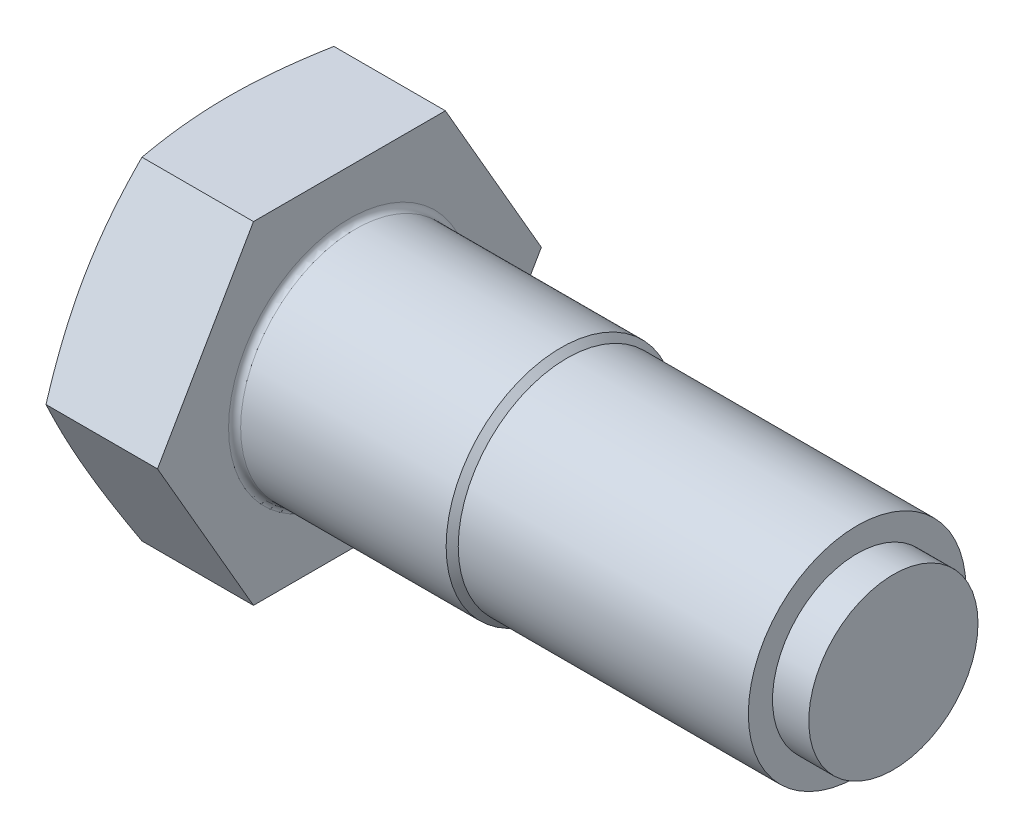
ISO-10303-21;
HEADER;
FILE_DESCRIPTION(('STEP AP214'),'2;1');
FILE_NAME('part.step','',(''),(''),'','','');
FILE_SCHEMA(('AUTOMOTIVE_DESIGN { 1 0 10303 214 1 1 1 1 }'));
ENDSEC;
DATA;
#1=APPLICATION_CONTEXT('core data for automotive mechanical design processes');
#2=APPLICATION_PROTOCOL_DEFINITION('international standard','automotive_design',2000,#1);
#3=PRODUCT_CONTEXT('',#1,'mechanical');
#4=PRODUCT('Part','Part','',(#3));
#5=PRODUCT_RELATED_PRODUCT_CATEGORY('part','',(#4));
#6=PRODUCT_DEFINITION_FORMATION('','',#4);
#7=PRODUCT_DEFINITION_CONTEXT('part definition',#1,'design');
#8=PRODUCT_DEFINITION('design','',#6,#7);
#9=PRODUCT_DEFINITION_SHAPE('','',#8);
#10=(LENGTH_UNIT() NAMED_UNIT(*) SI_UNIT(.MILLI.,.METRE.));
#11=(NAMED_UNIT(*) PLANE_ANGLE_UNIT() SI_UNIT($,.RADIAN.));
#12=(NAMED_UNIT(*) SI_UNIT($,.STERADIAN.) SOLID_ANGLE_UNIT());
#13=UNCERTAINTY_MEASURE_WITH_UNIT(LENGTH_MEASURE(1.E-05),#10,'distance_accuracy_value','');
#14=(GEOMETRIC_REPRESENTATION_CONTEXT(3) GLOBAL_UNCERTAINTY_ASSIGNED_CONTEXT((#13)) GLOBAL_UNIT_ASSIGNED_CONTEXT((#10,
#11,#12)) REPRESENTATION_CONTEXT('',''));
#15=CARTESIAN_POINT('',(0.,0.,0.));
#16=DIRECTION('',(0.,0.,1.));
#17=DIRECTION('',(1.,0.,0.));
#18=AXIS2_PLACEMENT_3D('',#15,#16,#17);
#19=CARTESIAN_POINT('',(20.,-27.5,-15.8771324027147));
#20=DIRECTION('',(0.,0.5,0.866025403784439));
#21=DIRECTION('',(0.,-0.866025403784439,0.5));
#22=AXIS2_PLACEMENT_3D('',#19,#20,#21);
#23=PLANE('',#22);
#24=CARTESIAN_POINT('',(1.54846778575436,0.00020000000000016,-31.7543802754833));
#25=CARTESIAN_POINT('',(1.4288019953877,-0.569305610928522,-31.4255760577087));
#26=CARTESIAN_POINT('',(1.314517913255,-1.13964819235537,-31.0962886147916));
#27=CARTESIAN_POINT('',(1.09789705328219,-2.28208500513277,-30.4367024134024));
#28=CARTESIAN_POINT('',(0.995561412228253,-2.85417939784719,-30.1064035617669));
#29=CARTESIAN_POINT('',(0.708153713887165,-4.57383623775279,-29.1135592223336));
#30=CARTESIAN_POINT('',(0.542849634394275,-5.72398507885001,-28.449520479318));
#31=CARTESIAN_POINT('',(0.341953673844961,-7.44775186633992,-27.4543032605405));
#32=CARTESIAN_POINT('',(0.283002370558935,-8.01938098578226,-27.1242730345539));
#33=CARTESIAN_POINT('',(0.181195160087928,-9.16373285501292,-26.4635811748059));
#34=CARTESIAN_POINT('',(0.138339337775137,-9.73645561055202,-26.1329195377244));
#35=CARTESIAN_POINT('',(0.0694763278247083,-10.8824518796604,-25.4712782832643));
#36=CARTESIAN_POINT('',(0.0434629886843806,-11.4557251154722,-25.1402988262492));
#37=CARTESIAN_POINT('',(0.00872485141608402,-12.6026655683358,-24.4781124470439));
#38=CARTESIAN_POINT('',(0.,-13.1763327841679,-24.146905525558));
#39=CARTESIAN_POINT('',(0.,-14.3236672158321,-23.4844916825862));
#40=CARTESIAN_POINT('',(0.00872485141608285,-14.8973344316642,-23.1532847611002));
#41=CARTESIAN_POINT('',(0.0434629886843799,-16.0442748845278,-22.4910983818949));
#42=CARTESIAN_POINT('',(0.0694763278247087,-16.6175481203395,-22.1601189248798));
#43=CARTESIAN_POINT('',(0.138339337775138,-17.763544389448,-21.4984776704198));
#44=CARTESIAN_POINT('',(0.181195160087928,-18.3362671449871,-21.1678160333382));
#45=CARTESIAN_POINT('',(0.283002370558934,-19.4806190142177,-20.5071241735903));
#46=CARTESIAN_POINT('',(0.34195367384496,-20.0522481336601,-20.1770939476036));
#47=CARTESIAN_POINT('',(0.542849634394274,-21.77601492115,-19.1818767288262));
#48=CARTESIAN_POINT('',(0.708153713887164,-22.9261637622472,-18.5178379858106));
#49=CARTESIAN_POINT('',(0.995561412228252,-24.6458206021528,-17.5249936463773));
#50=CARTESIAN_POINT('',(1.09789705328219,-25.2179149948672,-17.1946947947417));
#51=CARTESIAN_POINT('',(1.314517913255,-26.3603518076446,-16.5351085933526));
#52=CARTESIAN_POINT('',(1.4288019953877,-26.9306943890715,-16.2058211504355));
#53=CARTESIAN_POINT('',(1.54846778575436,-27.5002,-15.8770169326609));
#54=B_SPLINE_CURVE_WITH_KNOTS('',3,(#24,#25,#26,#27,#28,#29,#30,#31,#32,#33,#34,#35,#36,#37,#38,
#39,#40,#41,#42,#43,#44,#45,#46,#47,#48,#49,#50,#51,#52,#53),.UNSPECIFIED.,.F.,.F.,(4,2,2,2,2,2,
2,2,2,2,2,2,2,2,4),(0.,2.00516331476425,4.0105172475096,8.0239972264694,10.0119037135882,
11.9998206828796,13.987011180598,15.9741955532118,17.9613799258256,19.9485704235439,
21.9364873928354,23.9243938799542,27.937873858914,29.9432277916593,31.9483911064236),.UNSPECIFIED.);
#55=CARTESIAN_POINT('',(1.54842575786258,0.,-31.7542648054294));
#56=VERTEX_POINT('',#55);
#57=CARTESIAN_POINT('',(0.,-13.75,-23.8156986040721));
#58=VERTEX_POINT('',#57);
#59=EDGE_CURVE('E117',#56,#58,#54,.T.);
#60=ORIENTED_EDGE('',*,*,#59,.F.);
#61=DIRECTION('',(-1.,0.,0.));
#62=VECTOR('',#61,1.);
#63=CARTESIAN_POINT('',(20.,0.,-31.7542648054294));
#64=LINE('',#63,#62);
#65=CARTESIAN_POINT('',(20.,0.,-31.7542648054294));
#66=VERTEX_POINT('',#65);
#67=EDGE_CURVE('E146',#66,#56,#64,.T.);
#68=ORIENTED_EDGE('',*,*,#67,.F.);
#69=DIRECTION('',(0.,0.866025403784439,-0.5));
#70=VECTOR('',#69,1.);
#71=CARTESIAN_POINT('',(20.,-27.5,-15.8771324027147));
#72=LINE('',#71,#70);
#73=CARTESIAN_POINT('',(20.,-27.5,-15.8771324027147));
#74=VERTEX_POINT('',#73);
#75=EDGE_CURVE('E181',#74,#66,#72,.T.);
#76=ORIENTED_EDGE('',*,*,#75,.F.);
#77=DIRECTION('',(-1.,0.,0.));
#78=VECTOR('',#77,1.);
#79=CARTESIAN_POINT('',(20.,-27.5,-15.8771324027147));
#80=LINE('',#79,#78);
#81=CARTESIAN_POINT('',(1.54842575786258,-27.5,-15.8771324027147));
#82=VERTEX_POINT('',#81);
#83=EDGE_CURVE('E140',#74,#82,#80,.T.);
#84=ORIENTED_EDGE('',*,*,#83,.T.);
#85=EDGE_CURVE('E202',#58,#82,#54,.T.);
#86=ORIENTED_EDGE('',*,*,#85,.F.);
#87=EDGE_LOOP('',(#60,#68,#76,#84,#86));
#88=FACE_BOUND('',#87,.T.);
#89=ADVANCED_FACE('F35',(#88),#23,.F.);
#90=CARTESIAN_POINT('',(20.,0.,-31.7542648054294));
#91=DIRECTION('',(0.,-0.5,0.866025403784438));
#92=DIRECTION('',(0.,-0.866025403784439,-0.5));
#93=AXIS2_PLACEMENT_3D('',#90,#91,#92);
#94=PLANE('',#93);
#95=CARTESIAN_POINT('',(1.54846778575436,27.5002,-15.8770169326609));
#96=CARTESIAN_POINT('',(1.42880199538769,26.9306943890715,-16.2058211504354));
#97=CARTESIAN_POINT('',(1.314517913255,26.3603518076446,-16.5351085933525));
#98=CARTESIAN_POINT('',(1.09789705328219,25.2179149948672,-17.1946947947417));
#99=CARTESIAN_POINT('',(0.99556141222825,24.6458206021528,-17.5249936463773));
#100=CARTESIAN_POINT('',(0.708153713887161,22.9261637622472,-18.5178379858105));
#101=CARTESIAN_POINT('',(0.542849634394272,21.77601492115,-19.1818767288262));
#102=CARTESIAN_POINT('',(0.341953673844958,20.0522481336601,-20.1770939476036));
#103=CARTESIAN_POINT('',(0.283002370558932,19.4806190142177,-20.5071241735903));
#104=CARTESIAN_POINT('',(0.181195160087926,18.3362671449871,-21.1678160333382));
#105=CARTESIAN_POINT('',(0.138339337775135,17.763544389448,-21.4984776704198));
#106=CARTESIAN_POINT('',(0.0694763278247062,16.6175481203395,-22.1601189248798));
#107=CARTESIAN_POINT('',(0.0434629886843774,16.0442748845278,-22.4910983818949));
#108=CARTESIAN_POINT('',(0.00872485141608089,14.8973344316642,-23.1532847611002));
#109=CARTESIAN_POINT('',(0.,14.3236672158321,-23.4844916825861));
#110=CARTESIAN_POINT('',(0.,13.1763327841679,-24.146905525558));
#111=CARTESIAN_POINT('',(0.00872485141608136,12.6026655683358,-24.4781124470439));
#112=CARTESIAN_POINT('',(0.0434629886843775,11.4557251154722,-25.1402988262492));
#113=CARTESIAN_POINT('',(0.0694763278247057,10.8824518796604,-25.4712782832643));
#114=CARTESIAN_POINT('',(0.138339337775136,9.73645561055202,-26.1329195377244));
#115=CARTESIAN_POINT('',(0.181195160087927,9.16373285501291,-26.4635811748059));
#116=CARTESIAN_POINT('',(0.283002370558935,8.01938098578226,-27.1242730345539));
#117=CARTESIAN_POINT('',(0.341953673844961,7.44775186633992,-27.4543032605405));
#118=CARTESIAN_POINT('',(0.542849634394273,5.72398507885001,-28.449520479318));
#119=CARTESIAN_POINT('',(0.708153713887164,4.57383623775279,-29.1135592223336));
#120=CARTESIAN_POINT('',(0.995561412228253,2.85417939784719,-30.1064035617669));
#121=CARTESIAN_POINT('',(1.09789705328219,2.28208500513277,-30.4367024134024));
#122=CARTESIAN_POINT('',(1.314517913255,1.13964819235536,-31.0962886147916));
#123=CARTESIAN_POINT('',(1.4288019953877,0.56930561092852,-31.4255760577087));
#124=CARTESIAN_POINT('',(1.54846778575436,-0.000199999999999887,-31.7543802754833));
#125=B_SPLINE_CURVE_WITH_KNOTS('',3,(#95,#96,#97,#98,#99,#100,#101,#102,#103,#104,#105,#106,
#107,#108,#109,#110,#111,#112,#113,#114,#115,#116,#117,#118,#119,#120,#121,#122,#123,#124),
.UNSPECIFIED.,.F.,.F.,(4,2,2,2,2,2,2,2,2,2,2,2,2,2,4),(0.,2.00516331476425,4.0105172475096,
8.0239972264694,10.0119037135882,11.9998206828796,13.987011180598,15.9741955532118,
17.9613799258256,19.948570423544,21.9364873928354,23.9243938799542,27.937873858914,
29.9432277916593,31.9483911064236),.UNSPECIFIED.);
#126=CARTESIAN_POINT('',(1.54842575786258,27.5,-15.8771324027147));
#127=VERTEX_POINT('',#126);
#128=CARTESIAN_POINT('',(0.,13.75,-23.8156986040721));
#129=VERTEX_POINT('',#128);
#130=EDGE_CURVE('E253',#127,#129,#125,.T.);
#131=ORIENTED_EDGE('',*,*,#130,.F.);
#132=DIRECTION('',(-1.,0.,0.));
#133=VECTOR('',#132,1.);
#134=CARTESIAN_POINT('',(20.,27.5,-15.8771324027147));
#135=LINE('',#134,#133);
#136=CARTESIAN_POINT('',(20.,27.5,-15.8771324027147));
#137=VERTEX_POINT('',#136);
#138=EDGE_CURVE('E137',#137,#127,#135,.T.);
#139=ORIENTED_EDGE('',*,*,#138,.F.);
#140=DIRECTION('',(0.,0.866025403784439,0.5));
#141=VECTOR('',#140,1.);
#142=CARTESIAN_POINT('',(20.,0.,-31.7542648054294));
#143=LINE('',#142,#141);
#144=EDGE_CURVE('E184',#66,#137,#143,.T.);
#145=ORIENTED_EDGE('',*,*,#144,.F.);
#146=ORIENTED_EDGE('',*,*,#67,.T.);
#147=EDGE_CURVE('E129',#129,#56,#125,.T.);
#148=ORIENTED_EDGE('',*,*,#147,.F.);
#149=EDGE_LOOP('',(#131,#139,#145,#146,#148));
#150=FACE_BOUND('',#149,.T.);
#151=ADVANCED_FACE('F259',(#150),#94,.F.);
#152=CARTESIAN_POINT('',(20.,27.5,-15.8771324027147));
#153=DIRECTION('',(0.,-1.,0.));
#154=DIRECTION('',(0.,0.,-1.));
#155=AXIS2_PLACEMENT_3D('',#152,#153,#154);
#156=PLANE('',#155);
#157=CARTESIAN_POINT('',(8.27417466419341,27.5,-42.0370686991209));
#158=CARTESIAN_POINT('',(8.08469919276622,27.5,-41.4149780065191));
#159=CARTESIAN_POINT('',(7.89636957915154,27.5,-40.7925385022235));
#160=CARTESIAN_POINT('',(7.52225859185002,27.5,-39.5468904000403));
#161=CARTESIAN_POINT('',(7.33647723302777,27.5,-38.9236817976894));
#162=CARTESIAN_POINT('',(6.78331637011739,27.5,-37.0527138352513));
#163=CARTESIAN_POINT('',(6.42014816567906,27.5,-35.8037042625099));
#164=CARTESIAN_POINT('',(5.70696403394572,27.5,-33.2994065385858));
#165=CARTESIAN_POINT('',(5.35697390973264,27.5,-32.044111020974));
#166=CARTESIAN_POINT('',(4.67421339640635,27.5,-29.52885103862));
#167=CARTESIAN_POINT('',(4.34144269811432,27.5,-28.268886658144));
#168=CARTESIAN_POINT('',(3.70136564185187,27.5,-25.7590181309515));
#169=CARTESIAN_POINT('',(3.39379590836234,27.5,-24.5091814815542));
#170=CARTESIAN_POINT('',(2.80484197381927,27.5,-22.003288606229));
#171=CARTESIAN_POINT('',(2.52345821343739,27.5,-20.7472322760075));
#172=CARTESIAN_POINT('',(1.99343662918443,27.5,-18.2286202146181));
#173=CARTESIAN_POINT('',(1.74478763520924,27.5,-16.9660668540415));
#174=CARTESIAN_POINT('',(1.2878080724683,27.5,-14.4336263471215));
#175=CARTESIAN_POINT('',(1.07947615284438,27.5,-13.1637394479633));
#176=CARTESIAN_POINT('',(0.73221733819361,27.5,-10.7596434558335));
#177=CARTESIAN_POINT('',(0.588127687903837,27.5,-9.62618566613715));
#178=CARTESIAN_POINT('',(0.344229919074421,27.5,-7.35443322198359));
#179=CARTESIAN_POINT('',(0.244420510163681,27.5,-6.21613870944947));
#180=CARTESIAN_POINT('',(0.131462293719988,27.5,-4.50671356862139));
#181=CARTESIAN_POINT('',(0.0999397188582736,27.5,-3.9367559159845));
#182=CARTESIAN_POINT('',(0.0495040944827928,27.5,-2.79628740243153));
#183=CARTESIAN_POINT('',(0.0305907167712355,27.5,-2.22577655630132));
#184=CARTESIAN_POINT('',(0.00563365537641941,27.5,-1.08446909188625));
#185=CARTESIAN_POINT('',(-0.000409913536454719,27.5,-0.513672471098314));
#186=CARTESIAN_POINT('',(0.000453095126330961,27.5,0.627911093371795));
#187=CARTESIAN_POINT('',(0.00735967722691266,27.5,1.19869803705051));
#188=CARTESIAN_POINT('',(0.0340986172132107,27.5,2.34285703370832));
#189=CARTESIAN_POINT('',(0.0539961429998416,27.5,2.91622756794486));
#190=CARTESIAN_POINT('',(0.106503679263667,27.5,4.06239080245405));
#191=CARTESIAN_POINT('',(0.139114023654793,27.5,4.63518348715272));
#192=CARTESIAN_POINT('',(0.255413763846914,27.5,6.35229309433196));
#193=CARTESIAN_POINT('',(0.35757329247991,27.5,7.49539945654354));
#194=CARTESIAN_POINT('',(0.606427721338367,27.5,9.77763572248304));
#195=CARTESIAN_POINT('',(0.753160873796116,27.5,10.9167613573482));
#196=CARTESIAN_POINT('',(1.08519470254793,27.5,13.1893257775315));
#197=CARTESIAN_POINT('',(1.27049558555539,27.5,14.322764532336));
#198=CARTESIAN_POINT('',(1.68430124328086,27.5,16.6435833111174));
#199=CARTESIAN_POINT('',(1.91457283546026,27.5,17.8306453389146));
#200=CARTESIAN_POINT('',(2.40475304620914,27.5,20.1986744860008));
#201=CARTESIAN_POINT('',(2.66466389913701,27.5,21.3796411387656));
#202=CARTESIAN_POINT('',(3.20866537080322,27.5,23.7363199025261));
#203=CARTESIAN_POINT('',(3.49276301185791,27.5,24.9120303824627));
#204=CARTESIAN_POINT('',(4.08051653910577,27.5,27.2584986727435));
#205=CARTESIAN_POINT('',(4.38417195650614,27.5,28.4292566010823));
#206=CARTESIAN_POINT('',(5.00778544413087,27.5,30.7680175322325));
#207=CARTESIAN_POINT('',(5.32776395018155,27.5,31.9360150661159));
#208=CARTESIAN_POINT('',(5.98073735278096,27.5,34.2683610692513));
#209=CARTESIAN_POINT('',(6.31373230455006,27.5,35.4327095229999));
#210=CARTESIAN_POINT('',(6.99035616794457,27.5,37.7580938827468));
#211=CARTESIAN_POINT('',(7.33398328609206,27.5,38.919130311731));
#212=CARTESIAN_POINT('',(8.03007735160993,27.5,41.238543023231));
#213=CARTESIAN_POINT('',(8.38254428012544,27.5,42.396919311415));
#214=CARTESIAN_POINT('',(9.09091346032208,27.5,44.6986248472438));
#215=CARTESIAN_POINT('',(9.44673482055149,27.5,45.841979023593));
#216=CARTESIAN_POINT('',(10.1644386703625,27.5,48.1267816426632));
#217=CARTESIAN_POINT('',(10.5263211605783,27.5,49.2682300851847));
#218=CARTESIAN_POINT('',(11.2552369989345,27.5,51.5495374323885));
#219=CARTESIAN_POINT('',(11.622270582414,27.5,52.689396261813));
#220=CARTESIAN_POINT('',(12.3607173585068,27.5,54.9676946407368));
#221=CARTESIAN_POINT('',(12.7321305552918,27.5,56.106134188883));
#222=CARTESIAN_POINT('',(13.4772990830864,27.5,58.377460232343));
#223=CARTESIAN_POINT('',(13.8510401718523,27.5,59.5103514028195));
#224=CARTESIAN_POINT('',(14.6017474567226,27.5,61.7750649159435));
#225=CARTESIAN_POINT('',(14.9787136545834,27.5,62.9068872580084));
#226=CARTESIAN_POINT('',(15.7354151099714,27.5,65.169502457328));
#227=CARTESIAN_POINT('',(16.115150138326,27.5,66.3002953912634));
#228=CARTESIAN_POINT('',(16.8770773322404,27.5,68.5610502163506));
#229=CARTESIAN_POINT('',(17.2592694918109,27.5,69.6910121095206));
#230=CARTESIAN_POINT('',(17.6425199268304,27.5,70.8206140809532));
#231=B_SPLINE_CURVE_WITH_KNOTS('',3,(#157,#158,#159,#160,#161,#162,#163,#164,#165,#166,#167,
#168,#169,#170,#171,#172,#173,#174,#175,#176,#177,#178,#179,#180,#181,#182,#183,#184,#185,#186,
#187,#188,#189,#190,#191,#192,#193,#194,#195,#196,#197,#198,#199,#200,#201,#202,#203,#204,#205,
#206,#207,#208,#209,#210,#211,#212,#213,#214,#215,#216,#217,#218,#219,#220,#221,#222,#223,#224,
#225,#226,#227,#228,#229,#230),.UNSPECIFIED.,.F.,.F.,(4,2,2,2,2,2,2,2,2,2,2,2,2,2,2,2,2,2,2,2,2,
2,2,2,2,2,2,2,2,2,2,2,2,2,2,2,4),(0.,1.95091567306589,3.90184272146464,7.80398521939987,
11.713408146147,15.6227608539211,19.4839132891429,23.3451306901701,27.2050270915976,
31.0647941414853,34.4918070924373,37.9187201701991,39.6310896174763,41.3434144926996,
43.0557546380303,44.7680953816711,46.4890926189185,48.2101350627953,51.652046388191,
55.0969198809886,58.5418118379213,62.168920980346,65.7963037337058,69.4247432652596,
73.0530958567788,76.6861081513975,80.3191358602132,83.9515540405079,87.583964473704,
91.1762710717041,94.7685780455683,98.361049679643,101.953524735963,105.532363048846,
109.111203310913,112.689750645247,116.26828926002),.UNSPECIFIED.);
#232=CARTESIAN_POINT('',(1.54842575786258,27.5,15.8771324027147));
#233=VERTEX_POINT('',#232);
#234=CARTESIAN_POINT('',(0.,27.5,0.));
#235=VERTEX_POINT('',#234);
#236=EDGE_CURVE('E418',#233,#235,#231,.F.);
#237=ORIENTED_EDGE('',*,*,#236,.F.);
#238=DIRECTION('',(-1.,0.,0.));
#239=VECTOR('',#238,1.);
#240=CARTESIAN_POINT('',(20.,27.5,15.8771324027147));
#241=LINE('',#240,#239);
#242=CARTESIAN_POINT('',(20.,27.5,15.8771324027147));
#243=VERTEX_POINT('',#242);
#244=EDGE_CURVE('E134',#243,#233,#241,.T.);
#245=ORIENTED_EDGE('',*,*,#244,.F.);
#246=DIRECTION('',(0.,0.,1.));
#247=VECTOR('',#246,1.);
#248=CARTESIAN_POINT('',(20.,27.5,-15.8771324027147));
#249=LINE('',#248,#247);
#250=EDGE_CURVE('E190',#137,#243,#249,.T.);
#251=ORIENTED_EDGE('',*,*,#250,.F.);
#252=ORIENTED_EDGE('',*,*,#138,.T.);
#253=EDGE_CURVE('E254',#235,#127,#231,.F.);
#254=ORIENTED_EDGE('',*,*,#253,.F.);
#255=EDGE_LOOP('',(#237,#245,#251,#252,#254));
#256=FACE_BOUND('',#255,.T.);
#257=ADVANCED_FACE('F262',(#256),#156,.F.);
#258=CARTESIAN_POINT('',(20.,27.5,15.8771324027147));
#259=DIRECTION('',(0.,-0.5,-0.866025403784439));
#260=DIRECTION('',(0.,0.866025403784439,-0.5));
#261=AXIS2_PLACEMENT_3D('',#258,#259,#260);
#262=PLANE('',#261);
#263=CARTESIAN_POINT('',(1.54846778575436,-0.000199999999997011,31.7543802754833));
#264=CARTESIAN_POINT('',(1.42880199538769,0.569305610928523,31.4255760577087));
#265=CARTESIAN_POINT('',(1.314517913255,1.13964819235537,31.0962886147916));
#266=CARTESIAN_POINT('',(1.09789705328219,2.28208500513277,30.4367024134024));
#267=CARTESIAN_POINT('',(0.995561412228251,2.85417939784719,30.1064035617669));
#268=CARTESIAN_POINT('',(0.708153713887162,4.5738362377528,29.1135592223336));
#269=CARTESIAN_POINT('',(0.542849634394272,5.72398507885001,28.449520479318));
#270=CARTESIAN_POINT('',(0.341953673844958,7.44775186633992,27.4543032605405));
#271=CARTESIAN_POINT('',(0.283002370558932,8.01938098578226,27.1242730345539));
#272=CARTESIAN_POINT('',(0.181195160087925,9.16373285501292,26.4635811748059));
#273=CARTESIAN_POINT('',(0.138339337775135,9.73645561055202,26.1329195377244));
#274=CARTESIAN_POINT('',(0.0694763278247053,10.8824518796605,25.4712782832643));
#275=CARTESIAN_POINT('',(0.0434629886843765,11.4557251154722,25.1402988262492));
#276=CARTESIAN_POINT('',(0.00872485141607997,12.6026655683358,24.4781124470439));
#277=CARTESIAN_POINT('',(0.,13.1763327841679,24.146905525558));
#278=CARTESIAN_POINT('',(0.,14.3236672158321,23.4844916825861));
#279=CARTESIAN_POINT('',(0.00872485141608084,14.8973344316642,23.1532847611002));
#280=CARTESIAN_POINT('',(0.0434629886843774,16.0442748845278,22.4910983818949));
#281=CARTESIAN_POINT('',(0.0694763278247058,16.6175481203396,22.1601189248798));
#282=CARTESIAN_POINT('',(0.138339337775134,17.763544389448,21.4984776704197));
#283=CARTESIAN_POINT('',(0.181195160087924,18.3362671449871,21.1678160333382));
#284=CARTESIAN_POINT('',(0.283002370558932,19.4806190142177,20.5071241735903));
#285=CARTESIAN_POINT('',(0.341953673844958,20.0522481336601,20.1770939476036));
#286=CARTESIAN_POINT('',(0.542849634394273,21.77601492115,19.1818767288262));
#287=CARTESIAN_POINT('',(0.708153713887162,22.9261637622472,18.5178379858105));
#288=CARTESIAN_POINT('',(0.995561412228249,24.6458206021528,17.5249936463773));
#289=CARTESIAN_POINT('',(1.09789705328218,25.2179149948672,17.1946947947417));
#290=CARTESIAN_POINT('',(1.314517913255,26.3603518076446,16.5351085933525));
#291=CARTESIAN_POINT('',(1.42880199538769,26.9306943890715,16.2058211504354));
#292=CARTESIAN_POINT('',(1.54846778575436,27.5002,15.8770169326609));
#293=B_SPLINE_CURVE_WITH_KNOTS('',3,(#263,#264,#265,#266,#267,#268,#269,#270,#271,#272,#273,
#274,#275,#276,#277,#278,#279,#280,#281,#282,#283,#284,#285,#286,#287,#288,#289,#290,#291,#292),
.UNSPECIFIED.,.F.,.F.,(4,2,2,2,2,2,2,2,2,2,2,2,2,2,4),(0.,2.00516331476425,4.0105172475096,
8.0239972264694,10.0119037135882,11.9998206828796,13.987011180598,15.9741955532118,
17.9613799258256,19.948570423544,21.9364873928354,23.9243938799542,27.937873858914,
29.9432277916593,31.9483911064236),.UNSPECIFIED.);
#294=CARTESIAN_POINT('',(1.54842575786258,0.,31.7542648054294));
#295=VERTEX_POINT('',#294);
#296=CARTESIAN_POINT('',(0.,13.75,23.8156986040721));
#297=VERTEX_POINT('',#296);
#298=EDGE_CURVE('E111',#295,#297,#293,.T.);
#299=ORIENTED_EDGE('',*,*,#298,.F.);
#300=DIRECTION('',(-1.,0.,0.));
#301=VECTOR('',#300,1.);
#302=CARTESIAN_POINT('',(20.,0.,31.7542648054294));
#303=LINE('',#302,#301);
#304=CARTESIAN_POINT('',(20.,0.,31.7542648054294));
#305=VERTEX_POINT('',#304);
#306=EDGE_CURVE('E125',#305,#295,#303,.T.);
#307=ORIENTED_EDGE('',*,*,#306,.F.);
#308=DIRECTION('',(0.,-0.866025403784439,0.5));
#309=VECTOR('',#308,1.);
#310=CARTESIAN_POINT('',(20.,27.5,15.8771324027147));
#311=LINE('',#310,#309);
#312=EDGE_CURVE('E192',#243,#305,#311,.T.);
#313=ORIENTED_EDGE('',*,*,#312,.F.);
#314=ORIENTED_EDGE('',*,*,#244,.T.);
#315=EDGE_CURVE('E128',#297,#233,#293,.T.);
#316=ORIENTED_EDGE('',*,*,#315,.F.);
#317=EDGE_LOOP('',(#299,#307,#313,#314,#316));
#318=FACE_BOUND('',#317,.T.);
#319=ADVANCED_FACE('F123',(#318),#262,.F.);
#320=CARTESIAN_POINT('',(20.,0.,31.7542648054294));
#321=DIRECTION('',(0.,0.5,-0.866025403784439));
#322=DIRECTION('',(0.,0.866025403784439,0.5));
#323=AXIS2_PLACEMENT_3D('',#320,#321,#322);
#324=PLANE('',#323);
#325=CARTESIAN_POINT('',(1.54846778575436,-27.5002,15.8770169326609));
#326=CARTESIAN_POINT('',(1.42880199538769,-26.9306943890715,16.2058211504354));
#327=CARTESIAN_POINT('',(1.314517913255,-26.3603518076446,16.5351085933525));
#328=CARTESIAN_POINT('',(1.09789705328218,-25.2179149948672,17.1946947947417));
#329=CARTESIAN_POINT('',(0.995561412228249,-24.6458206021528,17.5249936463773));
#330=CARTESIAN_POINT('',(0.70815371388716,-22.9261637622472,18.5178379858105));
#331=CARTESIAN_POINT('',(0.54284963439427,-21.77601492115,19.1818767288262));
#332=CARTESIAN_POINT('',(0.341953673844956,-20.0522481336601,20.1770939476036));
#333=CARTESIAN_POINT('',(0.28300237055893,-19.4806190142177,20.5071241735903));
#334=CARTESIAN_POINT('',(0.181195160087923,-18.3362671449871,21.1678160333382));
#335=CARTESIAN_POINT('',(0.138339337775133,-17.763544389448,21.4984776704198));
#336=CARTESIAN_POINT('',(0.0694763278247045,-16.6175481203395,22.1601189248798));
#337=CARTESIAN_POINT('',(0.0434629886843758,-16.0442748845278,22.4910983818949));
#338=CARTESIAN_POINT('',(0.00872485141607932,-14.8973344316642,23.1532847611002));
#339=CARTESIAN_POINT('',(0.,-14.3236672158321,23.4844916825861));
#340=CARTESIAN_POINT('',(0.,-13.1763327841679,24.146905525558));
#341=CARTESIAN_POINT('',(0.0087248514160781,-12.6026655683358,24.4781124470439));
#342=CARTESIAN_POINT('',(0.0434629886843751,-11.4557251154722,25.1402988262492));
#343=CARTESIAN_POINT('',(0.0694763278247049,-10.8824518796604,25.4712782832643));
#344=CARTESIAN_POINT('',(0.138339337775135,-9.73645561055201,26.1329195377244));
#345=CARTESIAN_POINT('',(0.181195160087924,-9.16373285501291,26.4635811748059));
#346=CARTESIAN_POINT('',(0.283002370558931,-8.01938098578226,27.1242730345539));
#347=CARTESIAN_POINT('',(0.341953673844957,-7.44775186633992,27.4543032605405));
#348=CARTESIAN_POINT('',(0.542849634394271,-5.72398507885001,28.449520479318));
#349=CARTESIAN_POINT('',(0.70815371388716,-4.57383623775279,29.1135592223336));
#350=CARTESIAN_POINT('',(0.995561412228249,-2.85417939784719,30.1064035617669));
#351=CARTESIAN_POINT('',(1.09789705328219,-2.28208500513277,30.4367024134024));
#352=CARTESIAN_POINT('',(1.314517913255,-1.13964819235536,31.0962886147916));
#353=CARTESIAN_POINT('',(1.42880199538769,-0.569305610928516,31.4255760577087));
#354=CARTESIAN_POINT('',(1.54846778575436,0.000200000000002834,31.7543802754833));
#355=B_SPLINE_CURVE_WITH_KNOTS('',3,(#325,#326,#327,#328,#329,#330,#331,#332,#333,#334,#335,
#336,#337,#338,#339,#340,#341,#342,#343,#344,#345,#346,#347,#348,#349,#350,#351,#352,#353,#354),
.UNSPECIFIED.,.F.,.F.,(4,2,2,2,2,2,2,2,2,2,2,2,2,2,4),(0.,2.00516331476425,4.0105172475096,
8.0239972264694,10.0119037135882,11.9998206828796,13.987011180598,15.9741955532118,
17.9613799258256,19.948570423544,21.9364873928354,23.9243938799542,27.937873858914,
29.9432277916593,31.9483911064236),.UNSPECIFIED.);
#356=CARTESIAN_POINT('',(1.54842575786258,-27.5,15.8771324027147));
#357=VERTEX_POINT('',#356);
#358=CARTESIAN_POINT('',(0.,-13.75,23.8156986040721));
#359=VERTEX_POINT('',#358);
#360=EDGE_CURVE('E119',#357,#359,#355,.T.);
#361=ORIENTED_EDGE('',*,*,#360,.F.);
#362=DIRECTION('',(-1.,0.,0.));
#363=VECTOR('',#362,1.);
#364=CARTESIAN_POINT('',(20.,-27.5,15.8771324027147));
#365=LINE('',#364,#363);
#366=CARTESIAN_POINT('',(20.,-27.5,15.8771324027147));
#367=VERTEX_POINT('',#366);
#368=EDGE_CURVE('E135',#367,#357,#365,.T.);
#369=ORIENTED_EDGE('',*,*,#368,.F.);
#370=DIRECTION('',(0.,-0.866025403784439,-0.5));
#371=VECTOR('',#370,1.);
#372=CARTESIAN_POINT('',(20.,0.,31.7542648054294));
#373=LINE('',#372,#371);
#374=EDGE_CURVE('E133',#305,#367,#373,.T.);
#375=ORIENTED_EDGE('',*,*,#374,.F.);
#376=ORIENTED_EDGE('',*,*,#306,.T.);
#377=EDGE_CURVE('E108',#359,#295,#355,.T.);
#378=ORIENTED_EDGE('',*,*,#377,.F.);
#379=EDGE_LOOP('',(#361,#369,#375,#376,#378));
#380=FACE_BOUND('',#379,.T.);
#381=ADVANCED_FACE('F131',(#380),#324,.F.);
#382=CARTESIAN_POINT('',(20.,-27.5,15.8771324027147));
#383=DIRECTION('',(0.,1.,0.));
#384=DIRECTION('',(0.,0.,1.));
#385=AXIS2_PLACEMENT_3D('',#382,#383,#384);
#386=PLANE('',#385);
#387=CARTESIAN_POINT('',(8.27417317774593,-27.5,-42.0370638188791));
#388=CARTESIAN_POINT('',(8.08469774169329,-27.5,-41.4149732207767));
#389=CARTESIAN_POINT('',(7.89636816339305,-27.5,-40.792533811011));
#390=CARTESIAN_POINT('',(7.52225724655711,-27.5,-39.5468858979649));
#391=CARTESIAN_POINT('',(7.336475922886,-27.5,-38.9236773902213));
#392=CARTESIAN_POINT('',(6.78331516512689,-27.5,-37.0527097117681));
#393=CARTESIAN_POINT('',(6.42014703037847,-27.5,-35.8037003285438));
#394=CARTESIAN_POINT('',(5.70696303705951,-27.5,-33.299402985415));
#395=CARTESIAN_POINT('',(5.35697298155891,-27.5,-32.044107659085));
#396=CARTESIAN_POINT('',(4.67421260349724,-27.5,-29.5288480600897));
#397=CARTESIAN_POINT('',(4.34144197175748,-27.5,-28.2688838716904));
#398=CARTESIAN_POINT('',(3.70136504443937,-27.5,-25.7590157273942));
#399=CARTESIAN_POINT('',(3.39379537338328,-27.5,-24.5091792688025));
#400=CARTESIAN_POINT('',(2.80484155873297,-27.5,-22.0032867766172));
#401=CARTESIAN_POINT('',(2.52345785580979,-27.5,-20.7472306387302));
#402=CARTESIAN_POINT('',(1.99343637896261,-27.5,-18.2286189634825));
#403=CARTESIAN_POINT('',(1.74478743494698,-27.5,-16.9660657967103));
#404=CARTESIAN_POINT('',(1.28780796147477,-27.5,-14.4336256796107));
#405=CARTESIAN_POINT('',(1.07947608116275,-27.5,-13.163738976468));
#406=CARTESIAN_POINT('',(0.732217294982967,-27.5,-10.7596431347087));
#407=CARTESIAN_POINT('',(0.588127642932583,-27.5,-9.62618529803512));
#408=CARTESIAN_POINT('',(0.344229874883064,-27.5,-7.35443275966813));
#409=CARTESIAN_POINT('',(0.244420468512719,-27.5,-6.21613819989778));
#410=CARTESIAN_POINT('',(0.131462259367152,-27.5,-4.50671298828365));
#411=CARTESIAN_POINT('',(0.0999396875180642,-27.5,-3.9367553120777));
#412=CARTESIAN_POINT('',(0.0495040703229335,-27.5,-2.79628675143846));
#413=CARTESIAN_POINT('',(0.0305906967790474,-27.5,-2.22577588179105));
#414=CARTESIAN_POINT('',(0.00563364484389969,-27.5,-1.08446837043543));
#415=CARTESIAN_POINT('',(-0.000409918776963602,-27.5,-0.513671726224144));
#416=CARTESIAN_POINT('',(0.000453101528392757,-27.5,0.627911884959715));
#417=CARTESIAN_POINT('',(0.00735968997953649,-27.5,1.19869885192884));
#418=CARTESIAN_POINT('',(0.0340986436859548,-27.5,2.34285789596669));
#419=CARTESIAN_POINT('',(0.0539961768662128,-27.5,2.9162284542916));
#420=CARTESIAN_POINT('',(0.106503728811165,-27.5,4.06239173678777));
#421=CARTESIAN_POINT('',(0.139114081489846,-27.5,4.63518444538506));
#422=CARTESIAN_POINT('',(0.255413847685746,-27.5,6.35229412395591));
#423=CARTESIAN_POINT('',(0.357573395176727,-27.5,7.49540053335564));
#424=CARTESIAN_POINT('',(0.606427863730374,-27.5,9.77763689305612));
#425=CARTESIAN_POINT('',(0.753161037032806,-27.5,10.9167625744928));
#426=CARTESIAN_POINT('',(1.08519490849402,-27.5,13.1893270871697));
#427=CARTESIAN_POINT('',(1.27049581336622,-27.5,14.3227658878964));
#428=CARTESIAN_POINT('',(1.68430150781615,-27.5,16.6435847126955));
#429=CARTESIAN_POINT('',(1.9145731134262,-27.5,17.8306467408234));
#430=CARTESIAN_POINT('',(2.40475334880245,-27.5,20.1986758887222));
#431=CARTESIAN_POINT('',(2.66466421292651,-27.5,21.379642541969));
#432=CARTESIAN_POINT('',(3.20866570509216,-27.5,23.7363213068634));
#433=CARTESIAN_POINT('',(3.49276335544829,-27.5,24.9120317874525));
#434=CARTESIAN_POINT('',(4.08051689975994,-27.5,27.2585000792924));
#435=CARTESIAN_POINT('',(4.38417232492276,-27.5,28.4292580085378));
#436=CARTESIAN_POINT('',(5.00778582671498,-27.5,30.7680189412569));
#437=CARTESIAN_POINT('',(5.3277643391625,-27.5,31.9360164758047));
#438=CARTESIAN_POINT('',(5.98073775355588,-27.5,34.2683624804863));
#439=CARTESIAN_POINT('',(6.31373271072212,-27.5,35.4327109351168));
#440=CARTESIAN_POINT('',(6.99035658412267,-27.5,37.7580952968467));
#441=CARTESIAN_POINT('',(7.33398370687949,-27.5,38.919131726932));
#442=CARTESIAN_POINT('',(8.03007778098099,-27.5,41.2385444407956));
#443=CARTESIAN_POINT('',(8.38254471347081,-27.5,42.3969207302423));
#444=CARTESIAN_POINT('',(9.09091389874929,-27.5,44.6986262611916));
#445=CARTESIAN_POINT('',(9.44673526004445,-27.5,45.8419804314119));
#446=CARTESIAN_POINT('',(10.1644391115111,-27.5,48.1267830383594));
#447=CARTESIAN_POINT('',(10.5263216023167,-27.5,49.2682314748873));
#448=CARTESIAN_POINT('',(11.2552374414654,-27.5,51.5495388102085));
#449=CARTESIAN_POINT('',(11.6222710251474,-27.5,52.6893976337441));
#450=CARTESIAN_POINT('',(12.3607178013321,-27.5,54.967696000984));
#451=CARTESIAN_POINT('',(12.7321309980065,-27.5,56.1061355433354));
#452=CARTESIAN_POINT('',(13.4772995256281,-27.5,58.3774615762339));
#453=CARTESIAN_POINT('',(13.8510406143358,-27.5,59.5103527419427));
#454=CARTESIAN_POINT('',(14.6017478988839,-27.5,61.7750662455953));
#455=CARTESIAN_POINT('',(14.9787140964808,-27.5,62.9068885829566));
#456=CARTESIAN_POINT('',(15.7354155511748,-27.5,65.1695037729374));
#457=CARTESIAN_POINT('',(16.1151505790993,-27.5,66.3002967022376));
#458=CARTESIAN_POINT('',(16.8770777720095,-27.5,68.5610515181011));
#459=CARTESIAN_POINT('',(17.2592699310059,-27.5,69.6910134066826));
#460=CARTESIAN_POINT('',(17.6425203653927,-27.5,70.8206153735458));
#461=B_SPLINE_CURVE_WITH_KNOTS('',3,(#387,#388,#389,#390,#391,#392,#393,#394,#395,#396,#397,
#398,#399,#400,#401,#402,#403,#404,#405,#406,#407,#408,#409,#410,#411,#412,#413,#414,#415,#416,
#417,#418,#419,#420,#421,#422,#423,#424,#425,#426,#427,#428,#429,#430,#431,#432,#433,#434,#435,
#436,#437,#438,#439,#440,#441,#442,#443,#444,#445,#446,#447,#448,#449,#450,#451,#452,#453,#454,
#455,#456,#457,#458,#459,#460),.UNSPECIFIED.,.F.,.F.,(4,2,2,2,2,2,2,2,2,2,2,2,2,2,2,2,2,2,2,2,2,
2,2,2,2,2,2,2,2,2,2,2,2,2,2,2,4),(0.,1.95091537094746,3.90184211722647,7.8039840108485,
11.7134063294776,15.6227584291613,19.483910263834,23.3451270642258,27.2050228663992,
31.0647893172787,34.4918024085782,37.9187156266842,39.6310851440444,41.343410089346,
43.055750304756,44.7680911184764,46.489088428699,48.2101309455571,51.6520424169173,
55.0969160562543,58.5418081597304,62.1689173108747,65.7963000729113,69.4247396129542,
73.0530922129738,76.6861045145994,80.3191322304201,83.9515504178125,87.5839608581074,
91.1762674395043,94.7685743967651,98.361046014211,101.953521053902,105.532359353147,
109.111199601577,112.689746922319,116.2682855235),.UNSPECIFIED.);
#462=CARTESIAN_POINT('',(0.,-27.5,0.));
#463=VERTEX_POINT('',#462);
#464=EDGE_CURVE('E210',#82,#463,#461,.T.);
#465=ORIENTED_EDGE('',*,*,#464,.F.);
#466=ORIENTED_EDGE('',*,*,#83,.F.);
#467=DIRECTION('',(0.,0.,-1.));
#468=VECTOR('',#467,1.);
#469=CARTESIAN_POINT('',(20.,-27.5,15.8771324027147));
#470=LINE('',#469,#468);
#471=EDGE_CURVE('E195',#367,#74,#470,.T.);
#472=ORIENTED_EDGE('',*,*,#471,.F.);
#473=ORIENTED_EDGE('',*,*,#368,.T.);
#474=EDGE_CURVE('E211',#463,#357,#461,.T.);
#475=ORIENTED_EDGE('',*,*,#474,.F.);
#476=EDGE_LOOP('',(#465,#466,#472,#473,#475));
#477=FACE_BOUND('',#476,.T.);
#478=ADVANCED_FACE('F207',(#477),#386,.F.);
#479=CARTESIAN_POINT('',(250.911688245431,0.,0.));
#480=DIRECTION('',(-1.,0.,0.));
#481=DIRECTION('',(0.,0.,1.));
#482=AXIS2_PLACEMENT_3D('',#479,#480,#481);
#483=CYLINDRICAL_SURFACE('',#482,18.);
#484=CARTESIAN_POINT('',(56.0000000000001,0.,0.));
#485=DIRECTION('',(1.,0.,0.));
#486=DIRECTION('',(0.,0.,-1.));
#487=AXIS2_PLACEMENT_3D('',#484,#485,#486);
#488=CIRCLE('',#487,18.);
#489=CARTESIAN_POINT('',(56.0000000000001,0.,18.));
#490=VERTEX_POINT('',#489);
#491=EDGE_CURVE('E13',#490,#490,#488,.T.);
#492=CARTESIAN_POINT('',(104.,0.,0.));
#493=DIRECTION('',(1.,0.,0.));
#494=DIRECTION('',(0.,0.,-1.));
#495=AXIS2_PLACEMENT_3D('',#492,#493,#494);
#496=CIRCLE('',#495,18.);
#497=CARTESIAN_POINT('',(104.,0.,18.));
#498=VERTEX_POINT('',#497);
#499=EDGE_CURVE('E149',#498,#498,#496,.T.);
#500=CARTESIAN_POINT('',(56.0000000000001,0.,18.));
#501=CARTESIAN_POINT('',(56.5000000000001,0.,18.));
#502=CARTESIAN_POINT('',(57.0000000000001,0.,18.));
#503=CARTESIAN_POINT('',(58.0000000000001,0.,18.));
#504=CARTESIAN_POINT('',(58.5000000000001,0.,18.));
#505=CARTESIAN_POINT('',(59.5000000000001,0.,18.));
#506=CARTESIAN_POINT('',(60.0000000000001,0.,18.));
#507=CARTESIAN_POINT('',(61.0000000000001,0.,18.));
#508=CARTESIAN_POINT('',(61.5000000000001,0.,18.));
#509=CARTESIAN_POINT('',(62.5000000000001,0.,18.));
#510=CARTESIAN_POINT('',(63.0000000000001,0.,18.));
#511=CARTESIAN_POINT('',(64.0000000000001,0.,18.));
#512=CARTESIAN_POINT('',(64.5000000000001,0.,18.));
#513=CARTESIAN_POINT('',(65.5000000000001,0.,18.));
#514=CARTESIAN_POINT('',(66.0000000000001,0.,18.));
#515=CARTESIAN_POINT('',(67.0000000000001,0.,18.));
#516=CARTESIAN_POINT('',(67.5000000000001,0.,18.));
#517=CARTESIAN_POINT('',(68.5000000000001,0.,18.));
#518=CARTESIAN_POINT('',(69.0000000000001,0.,18.));
#519=CARTESIAN_POINT('',(70.0000000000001,0.,18.));
#520=CARTESIAN_POINT('',(70.5000000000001,0.,18.));
#521=CARTESIAN_POINT('',(71.5000000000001,0.,18.));
#522=CARTESIAN_POINT('',(72.0000000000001,0.,18.));
#523=CARTESIAN_POINT('',(73.0000000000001,0.,18.));
#524=CARTESIAN_POINT('',(73.5000000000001,0.,18.));
#525=CARTESIAN_POINT('',(74.5000000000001,0.,18.));
#526=CARTESIAN_POINT('',(75.0000000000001,0.,18.));
#527=CARTESIAN_POINT('',(76.0000000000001,0.,18.));
#528=CARTESIAN_POINT('',(76.5000000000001,0.,18.));
#529=CARTESIAN_POINT('',(77.5,0.,18.));
#530=CARTESIAN_POINT('',(78.,0.,18.));
#531=CARTESIAN_POINT('',(79.,0.,18.));
#532=CARTESIAN_POINT('',(79.5,0.,18.));
#533=CARTESIAN_POINT('',(80.5,0.,18.));
#534=CARTESIAN_POINT('',(81.,0.,18.));
#535=CARTESIAN_POINT('',(82.,0.,18.));
#536=CARTESIAN_POINT('',(82.5,0.,18.));
#537=CARTESIAN_POINT('',(83.5,0.,18.));
#538=CARTESIAN_POINT('',(84.,0.,18.));
#539=CARTESIAN_POINT('',(85.,0.,18.));
#540=CARTESIAN_POINT('',(85.5,0.,18.));
#541=CARTESIAN_POINT('',(86.5,0.,18.));
#542=CARTESIAN_POINT('',(87.,0.,18.));
#543=CARTESIAN_POINT('',(88.,0.,18.));
#544=CARTESIAN_POINT('',(88.5,0.,18.));
#545=CARTESIAN_POINT('',(89.5,0.,18.));
#546=CARTESIAN_POINT('',(90.,0.,18.));
#547=CARTESIAN_POINT('',(91.,0.,18.));
#548=CARTESIAN_POINT('',(91.5,0.,18.));
#549=CARTESIAN_POINT('',(92.5,0.,18.));
#550=CARTESIAN_POINT('',(93.,0.,18.));
#551=CARTESIAN_POINT('',(94.,0.,18.));
#552=CARTESIAN_POINT('',(94.5,0.,18.));
#553=CARTESIAN_POINT('',(95.5,0.,18.));
#554=CARTESIAN_POINT('',(96.,0.,18.));
#555=CARTESIAN_POINT('',(97.,0.,18.));
#556=CARTESIAN_POINT('',(97.5,0.,18.));
#557=CARTESIAN_POINT('',(98.5,0.,18.));
#558=CARTESIAN_POINT('',(99.,0.,18.));
#559=CARTESIAN_POINT('',(100.,0.,18.));
#560=CARTESIAN_POINT('',(100.5,0.,18.));
#561=CARTESIAN_POINT('',(101.5,0.,18.));
#562=CARTESIAN_POINT('',(102.,0.,18.));
#563=CARTESIAN_POINT('',(103.,0.,18.));
#564=CARTESIAN_POINT('',(103.5,0.,18.));
#565=CARTESIAN_POINT('',(104.,0.,18.));
#566=B_SPLINE_CURVE_WITH_KNOTS('',3,(#500,#501,#502,#503,#504,#505,#506,#507,#508,#509,#510,
#511,#512,#513,#514,#515,#516,#517,#518,#519,#520,#521,#522,#523,#524,#525,#526,#527,#528,#529,
#530,#531,#532,#533,#534,#535,#536,#537,#538,#539,#540,#541,#542,#543,#544,#545,#546,#547,#548,
#549,#550,#551,#552,#553,#554,#555,#556,#557,#558,#559,#560,#561,#562,#563,#564,#565),
.UNSPECIFIED.,.F.,.F.,(4,2,2,2,2,2,2,2,2,2,2,2,2,2,2,2,2,2,2,2,2,2,2,2,2,2,2,2,2,2,2,2,4),(0.,
1.5,3.,4.49999999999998,5.99999999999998,7.49999999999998,8.99999999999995,10.5,12.,13.5,15.,
16.4999999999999,17.9999999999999,19.4999999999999,20.9999999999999,22.4999999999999,
23.9999999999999,25.4999999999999,26.9999999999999,28.4999999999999,29.9999999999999,
31.4999999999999,32.9999999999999,34.4999999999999,35.9999999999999,37.4999999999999,
38.9999999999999,40.4999999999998,41.9999999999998,43.4999999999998,44.9999999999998,
46.4999999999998,47.9999999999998),.UNSPECIFIED.);
#567=EDGE_CURVE('BSEAM274',#490,#498,#566,.T.);
#568=ORIENTED_EDGE('',*,*,#491,.T.);
#569=ORIENTED_EDGE('',*,*,#499,.F.);
#570=ORIENTED_EDGE('',*,*,#567,.T.);
#571=ORIENTED_EDGE('',*,*,#567,.F.);
#572=EDGE_LOOP('',(#568,#570,#569,#571));
#573=FACE_BOUND('',#572,.T.);
#574=ADVANCED_FACE('F274',(#573),#483,.T.);
#575=CARTESIAN_POINT('',(20.,-55.,0.));
#576=DIRECTION('',(-1.,0.,0.));
#577=DIRECTION('',(0.,0.,1.));
#578=AXIS2_PLACEMENT_3D('',#575,#576,#577);
#579=PLANE('',#578);
#580=CARTESIAN_POINT('',(20.,0.,0.));
#581=DIRECTION('',(-1.,0.,0.));
#582=DIRECTION('',(0.,0.,1.));
#583=AXIS2_PLACEMENT_3D('',#580,#581,#582);
#584=CIRCLE('',#583,20.);
#585=CARTESIAN_POINT('',(20.,0.,20.));
#586=VERTEX_POINT('',#585);
#587=EDGE_CURVE('E43',#586,#586,#584,.T.);
#588=ORIENTED_EDGE('',*,*,#587,.T.);
#589=EDGE_LOOP('',(#588));
#590=FACE_BOUND('',#589,.T.);
#591=ORIENTED_EDGE('',*,*,#75,.T.);
#592=ORIENTED_EDGE('',*,*,#144,.T.);
#593=ORIENTED_EDGE('',*,*,#250,.T.);
#594=ORIENTED_EDGE('',*,*,#312,.T.);
#595=ORIENTED_EDGE('',*,*,#374,.T.);
#596=ORIENTED_EDGE('',*,*,#471,.T.);
#597=EDGE_LOOP('',(#591,#592,#593,#594,#595,#596));
#598=FACE_BOUND('',#597,.T.);
#599=ADVANCED_FACE('F162',(#590,#598),#579,.F.);
#600=CARTESIAN_POINT('',(55.,0.,0.));
#601=DIRECTION('',(-1.,0.,0.));
#602=DIRECTION('',(0.,0.,1.));
#603=AXIS2_PLACEMENT_3D('',#600,#601,#602);
#604=CYLINDRICAL_SURFACE('',#603,19.);
#605=CARTESIAN_POINT('',(21.,0.,0.));
#606=DIRECTION('',(-1.,0.,0.));
#607=DIRECTION('',(0.,0.,1.));
#608=AXIS2_PLACEMENT_3D('',#605,#606,#607);
#609=CIRCLE('',#608,19.);
#610=CARTESIAN_POINT('',(21.,0.,19.));
#611=VERTEX_POINT('',#610);
#612=EDGE_CURVE('E157',#611,#611,#609,.F.);
#613=ORIENTED_EDGE('',*,*,#612,.T.);
#614=EDGE_LOOP('',(#613));
#615=FACE_BOUND('',#614,.T.);
#616=CARTESIAN_POINT('',(55.,0.,0.));
#617=DIRECTION('',(1.,0.,0.));
#618=DIRECTION('',(0.,0.,-1.));
#619=AXIS2_PLACEMENT_3D('',#616,#617,#618);
#620=CIRCLE('',#619,19.);
#621=CARTESIAN_POINT('',(55.,0.,-19.));
#622=VERTEX_POINT('',#621);
#623=EDGE_CURVE('E152',#622,#622,#620,.T.);
#624=ORIENTED_EDGE('',*,*,#623,.F.);
#625=EDGE_LOOP('',(#624));
#626=FACE_BOUND('',#625,.T.);
#627=ADVANCED_FACE('F173',(#615,#626),#604,.T.);
#628=CARTESIAN_POINT('',(104.,0.,0.));
#629=DIRECTION('',(1.,0.,0.));
#630=DIRECTION('',(0.,0.,-1.));
#631=AXIS2_PLACEMENT_3D('',#628,#629,#630);
#632=PLANE('',#631);
#633=CARTESIAN_POINT('',(104.,0.,0.));
#634=DIRECTION('',(1.,0.,0.));
#635=DIRECTION('',(0.,0.,-1.));
#636=AXIS2_PLACEMENT_3D('',#633,#634,#635);
#637=CIRCLE('',#636,14.);
#638=CARTESIAN_POINT('',(104.,0.,-14.));
#639=VERTEX_POINT('',#638);
#640=EDGE_CURVE('E153',#639,#639,#637,.T.);
#641=ORIENTED_EDGE('',*,*,#640,.F.);
#642=EDGE_LOOP('',(#641));
#643=FACE_BOUND('',#642,.T.);
#644=ORIENTED_EDGE('',*,*,#499,.T.);
#645=EDGE_LOOP('',(#644));
#646=FACE_BOUND('',#645,.T.);
#647=ADVANCED_FACE('F176',(#643,#646),#632,.T.);
#648=CARTESIAN_POINT('',(104.,0.,0.));
#649=DIRECTION('',(1.,0.,0.));
#650=DIRECTION('',(0.,0.,-1.));
#651=AXIS2_PLACEMENT_3D('',#648,#649,#650);
#652=CYLINDRICAL_SURFACE('',#651,14.);
#653=ORIENTED_EDGE('',*,*,#640,.T.);
#654=EDGE_LOOP('',(#653));
#655=FACE_BOUND('',#654,.T.);
#656=CARTESIAN_POINT('',(110.,0.,0.));
#657=DIRECTION('',(1.,0.,0.));
#658=DIRECTION('',(0.,0.,-1.));
#659=AXIS2_PLACEMENT_3D('',#656,#657,#658);
#660=CIRCLE('',#659,14.);
#661=CARTESIAN_POINT('',(110.,0.,-14.));
#662=VERTEX_POINT('',#661);
#663=EDGE_CURVE('E416',#662,#662,#660,.T.);
#664=ORIENTED_EDGE('',*,*,#663,.F.);
#665=EDGE_LOOP('',(#664));
#666=FACE_BOUND('',#665,.T.);
#667=ADVANCED_FACE('F234',(#655,#666),#652,.T.);
#668=CARTESIAN_POINT('',(110.,-55.,0.));
#669=DIRECTION('',(-1.,0.,0.));
#670=DIRECTION('',(0.,0.,1.));
#671=AXIS2_PLACEMENT_3D('',#668,#669,#670);
#672=PLANE('',#671);
#673=ORIENTED_EDGE('',*,*,#663,.T.);
#674=EDGE_LOOP('',(#673));
#675=FACE_BOUND('',#674,.T.);
#676=ADVANCED_FACE('F312',(#675),#672,.F.);
#677=CARTESIAN_POINT('',(0.,0.,0.));
#678=DIRECTION('',(1.,0.,0.));
#679=DIRECTION('',(0.,0.,-1.));
#680=AXIS2_PLACEMENT_3D('',#677,#678,#679);
#681=CONICAL_SURFACE('',#680,27.5,1.22173047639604);
#682=ORIENTED_EDGE('',*,*,#298,.T.);
#683=CARTESIAN_POINT('',(0.,0.,0.));
#684=DIRECTION('',(-1.,0.,0.));
#685=DIRECTION('',(0.,0.,1.));
#686=AXIS2_PLACEMENT_3D('',#683,#684,#685);
#687=CIRCLE('',#686,27.5);
#688=EDGE_CURVE('E113',#359,#297,#687,.T.);
#689=ORIENTED_EDGE('',*,*,#688,.F.);
#690=ORIENTED_EDGE('',*,*,#377,.T.);
#691=EDGE_LOOP('',(#682,#689,#690));
#692=FACE_BOUND('',#691,.T.);
#693=ADVANCED_FACE('F110',(#692),#681,.T.);
#694=ORIENTED_EDGE('',*,*,#360,.T.);
#695=EDGE_CURVE('E155',#463,#359,#687,.T.);
#696=ORIENTED_EDGE('',*,*,#695,.F.);
#697=ORIENTED_EDGE('',*,*,#474,.T.);
#698=EDGE_LOOP('',(#694,#696,#697));
#699=FACE_BOUND('',#698,.T.);
#700=ADVANCED_FACE('F232',(#699),#681,.T.);
#701=ORIENTED_EDGE('',*,*,#85,.T.);
#702=ORIENTED_EDGE('',*,*,#464,.T.);
#703=EDGE_CURVE('E58',#58,#463,#687,.T.);
#704=ORIENTED_EDGE('',*,*,#703,.F.);
#705=EDGE_LOOP('',(#701,#702,#704));
#706=FACE_BOUND('',#705,.T.);
#707=ADVANCED_FACE('F313',(#706),#681,.T.);
#708=ORIENTED_EDGE('',*,*,#147,.T.);
#709=ORIENTED_EDGE('',*,*,#59,.T.);
#710=EDGE_CURVE('E428',#129,#58,#687,.T.);
#711=ORIENTED_EDGE('',*,*,#710,.F.);
#712=EDGE_LOOP('',(#708,#709,#711));
#713=FACE_BOUND('',#712,.T.);
#714=ADVANCED_FACE('F314',(#713),#681,.T.);
#715=ORIENTED_EDGE('',*,*,#253,.T.);
#716=ORIENTED_EDGE('',*,*,#130,.T.);
#717=EDGE_CURVE('E156',#235,#129,#687,.T.);
#718=ORIENTED_EDGE('',*,*,#717,.F.);
#719=EDGE_LOOP('',(#715,#716,#718));
#720=FACE_BOUND('',#719,.T.);
#721=ADVANCED_FACE('F231',(#720),#681,.T.);
#722=ORIENTED_EDGE('',*,*,#236,.T.);
#723=CARTESIAN_POINT('',(0.,0.,0.));
#724=DIRECTION('',(-1.,0.,0.));
#725=DIRECTION('',(0.,0.,1.));
#726=AXIS2_PLACEMENT_3D('',#723,#724,#725);
#727=CIRCLE('',#726,27.5);
#728=EDGE_CURVE('E50',#297,#235,#727,.T.);
#729=ORIENTED_EDGE('',*,*,#728,.F.);
#730=ORIENTED_EDGE('',*,*,#315,.T.);
#731=EDGE_LOOP('',(#722,#729,#730));
#732=FACE_BOUND('',#731,.T.);
#733=ADVANCED_FACE('F227',(#732),#681,.T.);
#734=CARTESIAN_POINT('',(0.,-55.,0.));
#735=DIRECTION('',(-1.,0.,0.));
#736=DIRECTION('',(0.,0.,1.));
#737=AXIS2_PLACEMENT_3D('',#734,#735,#736);
#738=PLANE('',#737);
#739=ORIENTED_EDGE('',*,*,#688,.T.);
#740=ORIENTED_EDGE('',*,*,#728,.T.);
#741=ORIENTED_EDGE('',*,*,#717,.T.);
#742=ORIENTED_EDGE('',*,*,#710,.T.);
#743=ORIENTED_EDGE('',*,*,#703,.T.);
#744=ORIENTED_EDGE('',*,*,#695,.T.);
#745=EDGE_LOOP('',(#739,#740,#741,#742,#743,#744));
#746=FACE_BOUND('',#745,.T.);
#747=ADVANCED_FACE('F169',(#746),#738,.T.);
#748=CARTESIAN_POINT('',(21.,0.,0.));
#749=DIRECTION('',(-1.,0.,0.));
#750=DIRECTION('',(0.,0.,1.));
#751=AXIS2_PLACEMENT_3D('',#748,#749,#750);
#752=TOROIDAL_SURFACE('',#751,20.,1.);
#753=ORIENTED_EDGE('',*,*,#587,.F.);
#754=EDGE_LOOP('',(#753));
#755=FACE_BOUND('',#754,.T.);
#756=ORIENTED_EDGE('',*,*,#612,.F.);
#757=EDGE_LOOP('',(#756));
#758=FACE_BOUND('',#757,.T.);
#759=ADVANCED_FACE('F165',(#755,#758),#752,.F.);
#760=CARTESIAN_POINT('',(56.0000000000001,0.,0.));
#761=DIRECTION('',(-1.,0.,0.));
#762=DIRECTION('',(0.,0.,1.));
#763=AXIS2_PLACEMENT_3D('',#760,#761,#762);
#764=CONICAL_SURFACE('',#763,18.,0.785398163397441);
#765=ORIENTED_EDGE('',*,*,#623,.T.);
#766=EDGE_LOOP('',(#765));
#767=FACE_BOUND('',#766,.T.);
#768=ORIENTED_EDGE('',*,*,#491,.F.);
#769=EDGE_LOOP('',(#768));
#770=FACE_BOUND('',#769,.T.);
#771=ADVANCED_FACE('F168',(#767,#770),#764,.T.);
#772=CLOSED_SHELL('',(#89,#151,#257,#319,#381,#478,#574,#599,#627,#647,#667,#676,#693,#700,#707,
#714,#721,#733,#747,#759,#771));
#773=MANIFOLD_SOLID_BREP('B2',#772);
#774=ADVANCED_BREP_SHAPE_REPRESENTATION('',(#18,#773),#14);
#775=SHAPE_DEFINITION_REPRESENTATION(#9,#774);
ENDSEC;
END-ISO-10303-21;
